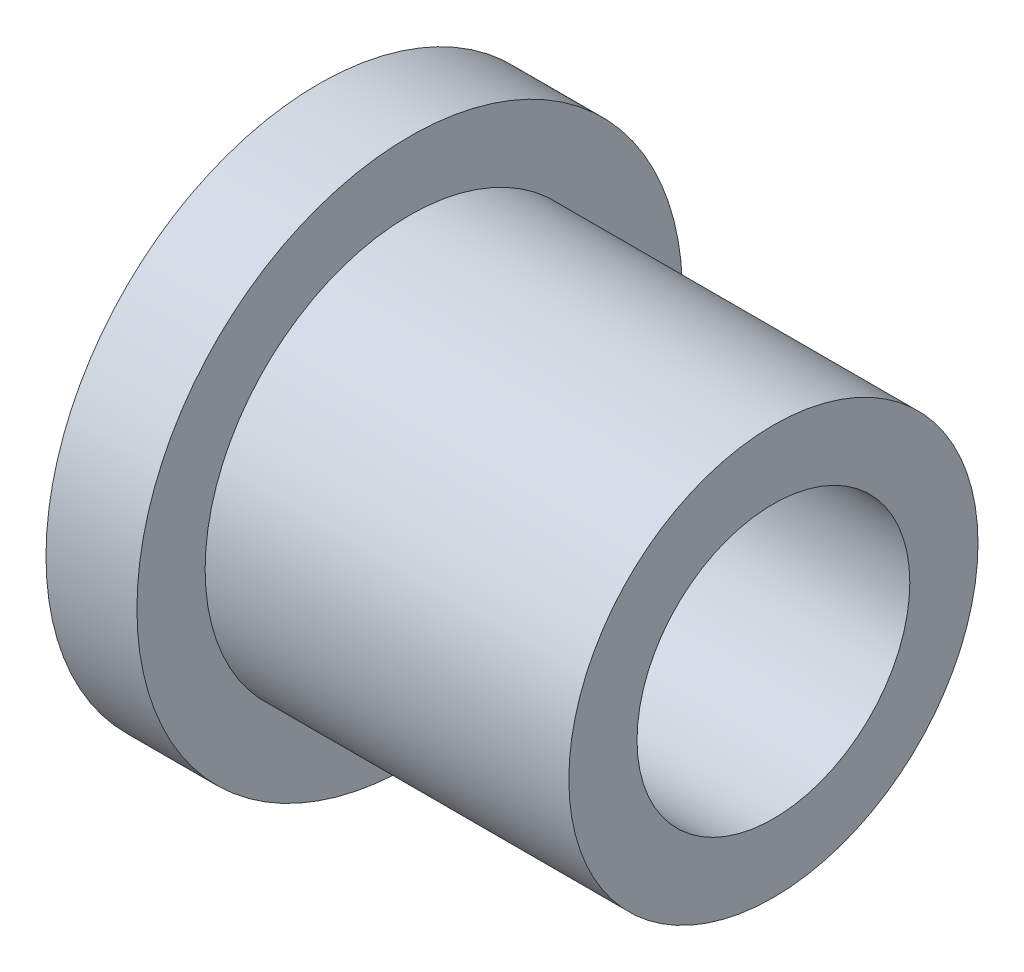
ISO-10303-21;
HEADER;
FILE_DESCRIPTION(('STEP AP214'),'2;1');
FILE_NAME('part.step','',(''),(''),'','','');
FILE_SCHEMA(('AUTOMOTIVE_DESIGN { 1 0 10303 214 1 1 1 1 }'));
ENDSEC;
DATA;
#1=APPLICATION_CONTEXT('core data for automotive mechanical design processes');
#2=APPLICATION_PROTOCOL_DEFINITION('international standard','automotive_design',2000,#1);
#3=PRODUCT_CONTEXT('',#1,'mechanical');
#4=PRODUCT('Part','Part','',(#3));
#5=PRODUCT_RELATED_PRODUCT_CATEGORY('part','',(#4));
#6=PRODUCT_DEFINITION_FORMATION('','',#4);
#7=PRODUCT_DEFINITION_CONTEXT('part definition',#1,'design');
#8=PRODUCT_DEFINITION('design','',#6,#7);
#9=PRODUCT_DEFINITION_SHAPE('','',#8);
#10=(LENGTH_UNIT() NAMED_UNIT(*) SI_UNIT(.MILLI.,.METRE.));
#11=(NAMED_UNIT(*) PLANE_ANGLE_UNIT() SI_UNIT($,.RADIAN.));
#12=(NAMED_UNIT(*) SI_UNIT($,.STERADIAN.) SOLID_ANGLE_UNIT());
#13=UNCERTAINTY_MEASURE_WITH_UNIT(LENGTH_MEASURE(1.E-05),#10,'distance_accuracy_value','');
#14=(GEOMETRIC_REPRESENTATION_CONTEXT(3) GLOBAL_UNCERTAINTY_ASSIGNED_CONTEXT((#13)) GLOBAL_UNIT_ASSIGNED_CONTEXT((#10,
#11,#12)) REPRESENTATION_CONTEXT('',''));
#15=CARTESIAN_POINT('',(0.,0.,0.));
#16=DIRECTION('',(0.,0.,1.));
#17=DIRECTION('',(1.,0.,0.));
#18=AXIS2_PLACEMENT_3D('',#15,#16,#17);
#19=CARTESIAN_POINT('',(0.,0.,0.));
#20=DIRECTION('',(-1.,0.,0.));
#21=DIRECTION('',(0.,0.,1.));
#22=AXIS2_PLACEMENT_3D('',#19,#20,#21);
#23=CYLINDRICAL_SURFACE('',#22,4.7625);
#24=CARTESIAN_POINT('',(15.875,0.,0.));
#25=DIRECTION('',(-1.,0.,0.));
#26=DIRECTION('',(0.,0.,1.));
#27=AXIS2_PLACEMENT_3D('',#24,#25,#26);
#28=CIRCLE('',#27,4.7625);
#29=CARTESIAN_POINT('',(15.875,0.,4.7625));
#30=VERTEX_POINT('',#29);
#31=EDGE_CURVE('E54',#30,#30,#28,.T.);
#32=ORIENTED_EDGE('',*,*,#31,.F.);
#33=EDGE_LOOP('',(#32));
#34=FACE_BOUND('',#33,.T.);
#35=CARTESIAN_POINT('',(0.,0.,0.));
#36=DIRECTION('',(-1.,0.,0.));
#37=DIRECTION('',(0.,0.,1.));
#38=AXIS2_PLACEMENT_3D('',#35,#36,#37);
#39=CIRCLE('',#38,4.7625);
#40=CARTESIAN_POINT('',(0.,0.,4.7625));
#41=VERTEX_POINT('',#40);
#42=EDGE_CURVE('E10',#41,#41,#39,.T.);
#43=ORIENTED_EDGE('',*,*,#42,.T.);
#44=EDGE_LOOP('',(#43));
#45=FACE_BOUND('',#44,.T.);
#46=ADVANCED_FACE('F32',(#34,#45),#23,.F.);
#47=CARTESIAN_POINT('',(0.,4.7625,0.));
#48=DIRECTION('',(1.,0.,0.));
#49=DIRECTION('',(0.,0.,-1.));
#50=AXIS2_PLACEMENT_3D('',#47,#48,#49);
#51=PLANE('',#50);
#52=ORIENTED_EDGE('',*,*,#42,.F.);
#53=EDGE_LOOP('',(#52));
#54=FACE_BOUND('',#53,.T.);
#55=CARTESIAN_POINT('',(0.,0.,0.));
#56=DIRECTION('',(-1.,0.,0.));
#57=DIRECTION('',(0.,0.,1.));
#58=AXIS2_PLACEMENT_3D('',#55,#56,#57);
#59=CIRCLE('',#58,9.525);
#60=CARTESIAN_POINT('',(0.,0.,9.525));
#61=VERTEX_POINT('',#60);
#62=EDGE_CURVE('E38',#61,#61,#59,.T.);
#63=ORIENTED_EDGE('',*,*,#62,.T.);
#64=EDGE_LOOP('',(#63));
#65=FACE_BOUND('',#64,.T.);
#66=ADVANCED_FACE('F61',(#54,#65),#51,.F.);
#67=CARTESIAN_POINT('',(0.,0.,0.));
#68=DIRECTION('',(-1.,0.,0.));
#69=DIRECTION('',(0.,0.,1.));
#70=AXIS2_PLACEMENT_3D('',#67,#68,#69);
#71=CYLINDRICAL_SURFACE('',#70,9.525);
#72=ORIENTED_EDGE('',*,*,#62,.F.);
#73=EDGE_LOOP('',(#72));
#74=FACE_BOUND('',#73,.T.);
#75=CARTESIAN_POINT('',(3.175,0.,0.));
#76=DIRECTION('',(-1.,0.,0.));
#77=DIRECTION('',(0.,0.,1.));
#78=AXIS2_PLACEMENT_3D('',#75,#76,#77);
#79=CIRCLE('',#78,9.525);
#80=CARTESIAN_POINT('',(3.175,0.,9.525));
#81=VERTEX_POINT('',#80);
#82=EDGE_CURVE('E42',#81,#81,#79,.T.);
#83=ORIENTED_EDGE('',*,*,#82,.T.);
#84=EDGE_LOOP('',(#83));
#85=FACE_BOUND('',#84,.T.);
#86=ADVANCED_FACE('F65',(#74,#85),#71,.T.);
#87=CARTESIAN_POINT('',(3.175,9.525,0.));
#88=DIRECTION('',(-1.,0.,0.));
#89=DIRECTION('',(0.,0.,1.));
#90=AXIS2_PLACEMENT_3D('',#87,#88,#89);
#91=PLANE('',#90);
#92=ORIENTED_EDGE('',*,*,#82,.F.);
#93=EDGE_LOOP('',(#92));
#94=FACE_BOUND('',#93,.T.);
#95=CARTESIAN_POINT('',(3.175,0.,0.));
#96=DIRECTION('',(-1.,0.,0.));
#97=DIRECTION('',(0.,0.,1.));
#98=AXIS2_PLACEMENT_3D('',#95,#96,#97);
#99=CIRCLE('',#98,7.14375);
#100=CARTESIAN_POINT('',(3.175,0.,7.14375));
#101=VERTEX_POINT('',#100);
#102=EDGE_CURVE('E46',#101,#101,#99,.T.);
#103=ORIENTED_EDGE('',*,*,#102,.T.);
#104=EDGE_LOOP('',(#103));
#105=FACE_BOUND('',#104,.T.);
#106=ADVANCED_FACE('F70',(#94,#105),#91,.F.);
#107=CARTESIAN_POINT('',(0.,0.,0.));
#108=DIRECTION('',(-1.,0.,0.));
#109=DIRECTION('',(0.,0.,1.));
#110=AXIS2_PLACEMENT_3D('',#107,#108,#109);
#111=CYLINDRICAL_SURFACE('',#110,7.14375);
#112=ORIENTED_EDGE('',*,*,#102,.F.);
#113=EDGE_LOOP('',(#112));
#114=FACE_BOUND('',#113,.T.);
#115=CARTESIAN_POINT('',(15.875,0.,0.));
#116=DIRECTION('',(-1.,0.,0.));
#117=DIRECTION('',(0.,0.,1.));
#118=AXIS2_PLACEMENT_3D('',#115,#116,#117);
#119=CIRCLE('',#118,7.14375);
#120=CARTESIAN_POINT('',(15.875,0.,7.14375));
#121=VERTEX_POINT('',#120);
#122=EDGE_CURVE('E51',#121,#121,#119,.T.);
#123=ORIENTED_EDGE('',*,*,#122,.T.);
#124=EDGE_LOOP('',(#123));
#125=FACE_BOUND('',#124,.T.);
#126=ADVANCED_FACE('F76',(#114,#125),#111,.T.);
#127=CARTESIAN_POINT('',(15.875,7.14375,0.));
#128=DIRECTION('',(-1.,0.,0.));
#129=DIRECTION('',(0.,0.,1.));
#130=AXIS2_PLACEMENT_3D('',#127,#128,#129);
#131=PLANE('',#130);
#132=ORIENTED_EDGE('',*,*,#122,.F.);
#133=EDGE_LOOP('',(#132));
#134=FACE_BOUND('',#133,.T.);
#135=ORIENTED_EDGE('',*,*,#31,.T.);
#136=EDGE_LOOP('',(#135));
#137=FACE_BOUND('',#136,.T.);
#138=ADVANCED_FACE('F58',(#134,#137),#131,.F.);
#139=CLOSED_SHELL('',(#46,#66,#86,#106,#126,#138));
#140=MANIFOLD_SOLID_BREP('B2',#139);
#141=ADVANCED_BREP_SHAPE_REPRESENTATION('',(#18,#140),#14);
#142=SHAPE_DEFINITION_REPRESENTATION(#9,#141);
ENDSEC;
END-ISO-10303-21;
